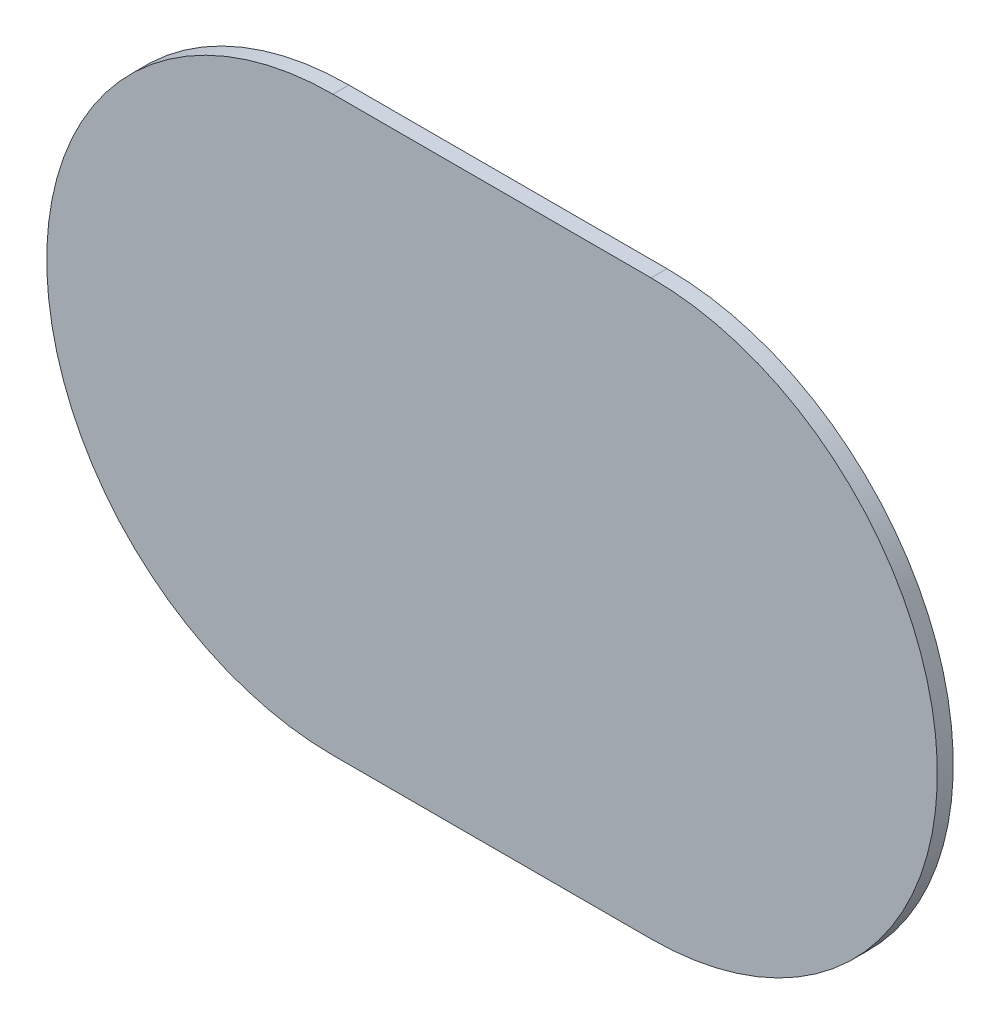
from build123d import *

# Parameters (mm, degrees)
BOSS_EXTRUDE1_DEPTH = 0.5


with BuildPart() as part:
    # Sketch1 → Boss-Extrude1 (new body)
    with BuildSketch(Plane.XY):
        with BuildLine():
            Line((0, 9), (10, 9))
            ThreePointArc((10, 9), (19, 0), (10, -9))
            Line((10, -9), (0, -9))
            ThreePointArc((0, -9), (-9, 0), (0, 9))
        make_face()
    extrude(amount=BOSS_EXTRUDE1_DEPTH)


solid = part.part
